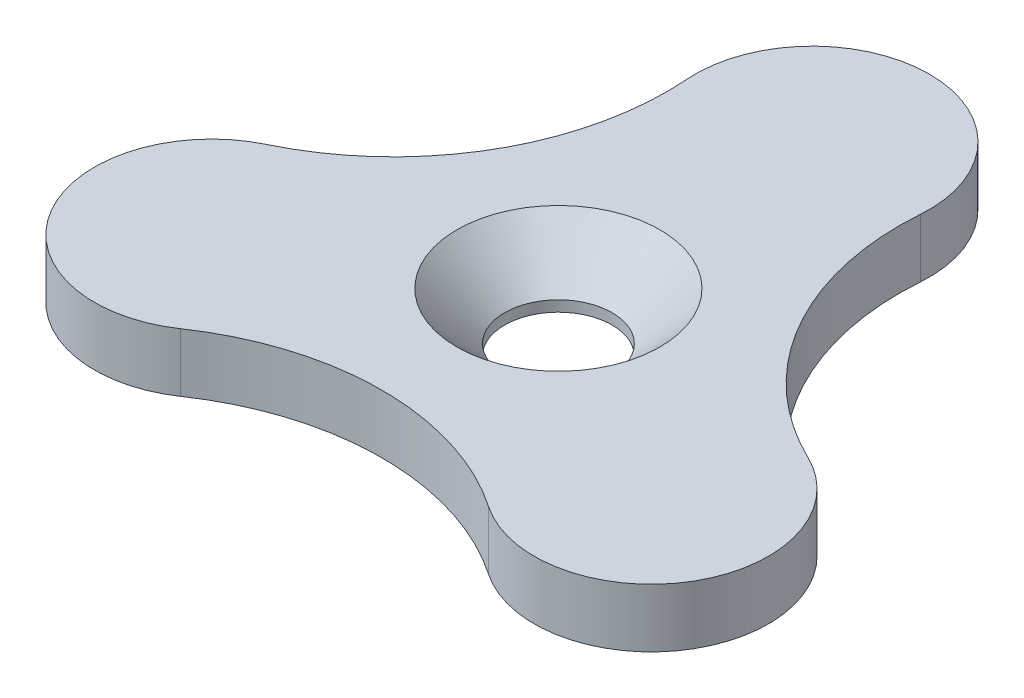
from build123d import *

# Parameters (mm, degrees)
EXTRUDE1_DEPTH = 3


with BuildPart() as part:
    # Sketch1 → Extrude1 (new body)
    with BuildSketch(Plane(origin=(0, 0, 0), x_dir=(1, 0, 0), z_dir=(0, 1, 0))):
        with BuildLine():
            ThreePointArc((5.983441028, 12.554541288), (0, 19), (-5.983441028, 12.554541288))
            ThreePointArc((-5.983441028, 12.554541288), (-7.820447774, 4.515137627), (-13.864272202, -1.095458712))
            ThreePointArc((-13.864272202, -1.095458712), (-16.454482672, -9.5), (-7.880831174, -11.459082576))
            ThreePointArc((-7.880831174, -11.459082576), (0, -9.030275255), (7.880831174, -11.459082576))
            ThreePointArc((7.880831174, -11.459082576), (16.454482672, -9.5), (13.864272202, -1.095458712))
            ThreePointArc((13.864272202, -1.095458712), (7.820447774, 4.515137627), (5.983441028, 12.554541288))
        make_face()
    extrude(amount=EXTRUDE1_DEPTH)

    # Sketch4 → CSK for M5 Countersunk Flat Head Screw2 (revolve, cut)
    with BuildSketch(Plane(origin=(0, 3, 0), x_dir=(0, 0, 1), z_dir=(1, 0, 0))):
        Polygon((0, 0), (0, 3), (2.75, 3), (2.75, 2.45), (5.2, 0), align=None)
    revolve(axis=Axis((0, 9.35, 0), (0, -1, 0)), mode=Mode.SUBTRACT)


solid = part.part
